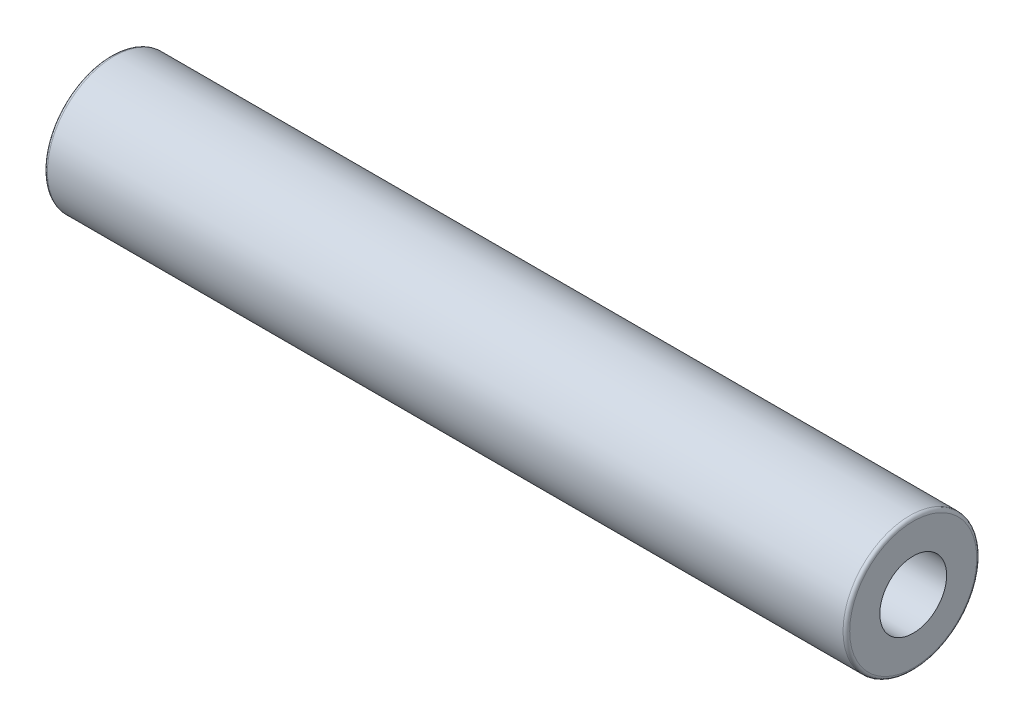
ISO-10303-21;
HEADER;
FILE_DESCRIPTION(('STEP AP214'),'2;1');
FILE_NAME('part.step','',(''),(''),'','','');
FILE_SCHEMA(('AUTOMOTIVE_DESIGN { 1 0 10303 214 1 1 1 1 }'));
ENDSEC;
DATA;
#1=APPLICATION_CONTEXT('core data for automotive mechanical design processes');
#2=APPLICATION_PROTOCOL_DEFINITION('international standard','automotive_design',2000,#1);
#3=PRODUCT_CONTEXT('',#1,'mechanical');
#4=PRODUCT('Part','Part','',(#3));
#5=PRODUCT_RELATED_PRODUCT_CATEGORY('part','',(#4));
#6=PRODUCT_DEFINITION_FORMATION('','',#4);
#7=PRODUCT_DEFINITION_CONTEXT('part definition',#1,'design');
#8=PRODUCT_DEFINITION('design','',#6,#7);
#9=PRODUCT_DEFINITION_SHAPE('','',#8);
#10=(LENGTH_UNIT() NAMED_UNIT(*) SI_UNIT(.MILLI.,.METRE.));
#11=(NAMED_UNIT(*) PLANE_ANGLE_UNIT() SI_UNIT($,.RADIAN.));
#12=(NAMED_UNIT(*) SI_UNIT($,.STERADIAN.) SOLID_ANGLE_UNIT());
#13=UNCERTAINTY_MEASURE_WITH_UNIT(LENGTH_MEASURE(1.E-05),#10,'distance_accuracy_value','');
#14=(GEOMETRIC_REPRESENTATION_CONTEXT(3) GLOBAL_UNCERTAINTY_ASSIGNED_CONTEXT((#13)) GLOBAL_UNIT_ASSIGNED_CONTEXT((#10,
#11,#12)) REPRESENTATION_CONTEXT('',''));
#15=CARTESIAN_POINT('',(0.,0.,0.));
#16=DIRECTION('',(0.,0.,1.));
#17=DIRECTION('',(1.,0.,0.));
#18=AXIS2_PLACEMENT_3D('',#15,#16,#17);
#19=CARTESIAN_POINT('',(0.,0.,0.));
#20=DIRECTION('',(1.,0.,0.));
#21=DIRECTION('',(0.,0.,-1.));
#22=AXIS2_PLACEMENT_3D('',#19,#20,#21);
#23=PLANE('',#22);
#24=CARTESIAN_POINT('',(0.,0.,0.));
#25=DIRECTION('',(1.,0.,0.));
#26=DIRECTION('',(0.,0.,-1.));
#27=AXIS2_PLACEMENT_3D('',#24,#25,#26);
#28=CIRCLE('',#27,9.5);
#29=CARTESIAN_POINT('',(0.,0.,-9.5));
#30=VERTEX_POINT('',#29);
#31=EDGE_CURVE('E29',#30,#30,#28,.F.);
#32=ORIENTED_EDGE('',*,*,#31,.T.);
#33=EDGE_LOOP('',(#32));
#34=FACE_BOUND('',#33,.T.);
#35=ADVANCED_FACE('F14',(#34),#23,.F.);
#36=CARTESIAN_POINT('',(0.,0.,0.));
#37=DIRECTION('',(-1.,0.,0.));
#38=DIRECTION('',(0.,0.,1.));
#39=AXIS2_PLACEMENT_3D('',#36,#37,#38);
#40=CYLINDRICAL_SURFACE('',#39,10.);
#41=CARTESIAN_POINT('',(0.5,0.,0.));
#42=DIRECTION('',(1.,0.,0.));
#43=DIRECTION('',(0.,0.,-1.));
#44=AXIS2_PLACEMENT_3D('',#41,#42,#43);
#45=CIRCLE('',#44,10.);
#46=CARTESIAN_POINT('',(0.5,0.,-10.));
#47=VERTEX_POINT('',#46);
#48=EDGE_CURVE('E21',#47,#47,#45,.T.);
#49=ORIENTED_EDGE('',*,*,#48,.T.);
#50=EDGE_LOOP('',(#49));
#51=FACE_BOUND('',#50,.T.);
#52=CARTESIAN_POINT('',(119.5,0.,0.));
#53=DIRECTION('',(-1.,0.,0.));
#54=DIRECTION('',(0.,0.,1.));
#55=AXIS2_PLACEMENT_3D('',#52,#53,#54);
#56=CIRCLE('',#55,10.);
#57=CARTESIAN_POINT('',(119.5,0.,10.));
#58=VERTEX_POINT('',#57);
#59=EDGE_CURVE('E25',#58,#58,#56,.T.);
#60=ORIENTED_EDGE('',*,*,#59,.T.);
#61=EDGE_LOOP('',(#60));
#62=FACE_BOUND('',#61,.T.);
#63=ADVANCED_FACE('F70',(#51,#62),#40,.T.);
#64=CARTESIAN_POINT('',(120.,10.,0.));
#65=DIRECTION('',(-1.,0.,0.));
#66=DIRECTION('',(0.,0.,1.));
#67=AXIS2_PLACEMENT_3D('',#64,#65,#66);
#68=PLANE('',#67);
#69=CARTESIAN_POINT('',(120.,0.,0.));
#70=DIRECTION('',(1.,0.,0.));
#71=DIRECTION('',(0.,0.,-1.));
#72=AXIS2_PLACEMENT_3D('',#69,#70,#71);
#73=CIRCLE('',#72,5.);
#74=CARTESIAN_POINT('',(120.,0.,-5.));
#75=VERTEX_POINT('',#74);
#76=EDGE_CURVE('E35',#75,#75,#73,.T.);
#77=ORIENTED_EDGE('',*,*,#76,.F.);
#78=EDGE_LOOP('',(#77));
#79=FACE_BOUND('',#78,.T.);
#80=CARTESIAN_POINT('',(120.,0.,0.));
#81=DIRECTION('',(-1.,0.,0.));
#82=DIRECTION('',(0.,0.,1.));
#83=AXIS2_PLACEMENT_3D('',#80,#81,#82);
#84=CIRCLE('',#83,9.5);
#85=CARTESIAN_POINT('',(120.,0.,9.5));
#86=VERTEX_POINT('',#85);
#87=EDGE_CURVE('E9',#86,#86,#84,.F.);
#88=ORIENTED_EDGE('',*,*,#87,.T.);
#89=EDGE_LOOP('',(#88));
#90=FACE_BOUND('',#89,.T.);
#91=ADVANCED_FACE('F67',(#79,#90),#68,.F.);
#92=CARTESIAN_POINT('',(0.5,0.,0.));
#93=DIRECTION('',(1.,0.,0.));
#94=DIRECTION('',(0.,0.,-1.));
#95=AXIS2_PLACEMENT_3D('',#92,#93,#94);
#96=TOROIDAL_SURFACE('',#95,9.5,0.5);
#97=ORIENTED_EDGE('',*,*,#48,.F.);
#98=EDGE_LOOP('',(#97));
#99=FACE_BOUND('',#98,.T.);
#100=ORIENTED_EDGE('',*,*,#31,.F.);
#101=EDGE_LOOP('',(#100));
#102=FACE_BOUND('',#101,.T.);
#103=ADVANCED_FACE('F69',(#99,#102),#96,.T.);
#104=CARTESIAN_POINT('',(119.5,0.,0.));
#105=DIRECTION('',(-1.,0.,0.));
#106=DIRECTION('',(0.,0.,1.));
#107=AXIS2_PLACEMENT_3D('',#104,#105,#106);
#108=TOROIDAL_SURFACE('',#107,9.5,0.5);
#109=ORIENTED_EDGE('',*,*,#87,.F.);
#110=EDGE_LOOP('',(#109));
#111=FACE_BOUND('',#110,.T.);
#112=ORIENTED_EDGE('',*,*,#59,.F.);
#113=EDGE_LOOP('',(#112));
#114=FACE_BOUND('',#113,.T.);
#115=ADVANCED_FACE('F16',(#111,#114),#108,.T.);
#116=CARTESIAN_POINT('',(100.,0.,0.));
#117=DIRECTION('',(1.,0.,0.));
#118=DIRECTION('',(0.,0.,-1.));
#119=AXIS2_PLACEMENT_3D('',#116,#117,#118);
#120=CYLINDRICAL_SURFACE('',#119,5.);
#121=CARTESIAN_POINT('',(100.,0.,0.));
#122=DIRECTION('',(1.,0.,0.));
#123=DIRECTION('',(0.,0.,-1.));
#124=AXIS2_PLACEMENT_3D('',#121,#122,#123);
#125=CIRCLE('',#124,5.);
#126=CARTESIAN_POINT('',(100.,0.,-5.));
#127=VERTEX_POINT('',#126);
#128=EDGE_CURVE('E34',#127,#127,#125,.T.);
#129=ORIENTED_EDGE('',*,*,#128,.F.);
#130=EDGE_LOOP('',(#129));
#131=FACE_BOUND('',#130,.T.);
#132=ORIENTED_EDGE('',*,*,#76,.T.);
#133=EDGE_LOOP('',(#132));
#134=FACE_BOUND('',#133,.T.);
#135=ADVANCED_FACE('F58',(#131,#134),#120,.F.);
#136=CARTESIAN_POINT('',(100.,0.,0.));
#137=DIRECTION('',(1.,0.,0.));
#138=DIRECTION('',(0.,0.,-1.));
#139=AXIS2_PLACEMENT_3D('',#136,#137,#138);
#140=PLANE('',#139);
#141=CARTESIAN_POINT('',(100.,0.,0.));
#142=DIRECTION('',(1.,0.,0.));
#143=DIRECTION('',(0.,0.,-1.));
#144=AXIS2_PLACEMENT_3D('',#141,#142,#143);
#145=CIRCLE('',#144,1.65);
#146=CARTESIAN_POINT('',(100.,0.,-1.65));
#147=VERTEX_POINT('',#146);
#148=EDGE_CURVE('E41',#147,#147,#145,.T.);
#149=ORIENTED_EDGE('',*,*,#148,.F.);
#150=EDGE_LOOP('',(#149));
#151=FACE_BOUND('',#150,.T.);
#152=ORIENTED_EDGE('',*,*,#128,.T.);
#153=EDGE_LOOP('',(#152));
#154=FACE_BOUND('',#153,.T.);
#155=ADVANCED_FACE('F52',(#151,#154),#140,.T.);
#156=CARTESIAN_POINT('',(96.,0.,0.));
#157=DIRECTION('',(1.,0.,0.));
#158=DIRECTION('',(0.,0.,-1.));
#159=AXIS2_PLACEMENT_3D('',#156,#157,#158);
#160=CYLINDRICAL_SURFACE('',#159,1.65);
#161=CARTESIAN_POINT('',(96.,0.,0.));
#162=DIRECTION('',(1.,0.,0.));
#163=DIRECTION('',(0.,0.,-1.));
#164=AXIS2_PLACEMENT_3D('',#161,#162,#163);
#165=CIRCLE('',#164,1.65);
#166=CARTESIAN_POINT('',(96.,0.,-1.65));
#167=VERTEX_POINT('',#166);
#168=EDGE_CURVE('E38',#167,#167,#165,.T.);
#169=ORIENTED_EDGE('',*,*,#168,.F.);
#170=EDGE_LOOP('',(#169));
#171=FACE_BOUND('',#170,.T.);
#172=ORIENTED_EDGE('',*,*,#148,.T.);
#173=EDGE_LOOP('',(#172));
#174=FACE_BOUND('',#173,.T.);
#175=ADVANCED_FACE('F49',(#171,#174),#160,.F.);
#176=CARTESIAN_POINT('',(96.,0.,0.));
#177=DIRECTION('',(1.,0.,0.));
#178=DIRECTION('',(0.,0.,-1.));
#179=AXIS2_PLACEMENT_3D('',#176,#177,#178);
#180=PLANE('',#179);
#181=ORIENTED_EDGE('',*,*,#168,.T.);
#182=EDGE_LOOP('',(#181));
#183=FACE_BOUND('',#182,.T.);
#184=ADVANCED_FACE('F47',(#183),#180,.T.);
#185=CLOSED_SHELL('',(#35,#63,#91,#103,#115,#135,#155,#175,#184));
#186=MANIFOLD_SOLID_BREP('B1',#185);
#187=ADVANCED_BREP_SHAPE_REPRESENTATION('',(#18,#186),#14);
#188=SHAPE_DEFINITION_REPRESENTATION(#9,#187);
ENDSEC;
END-ISO-10303-21;
